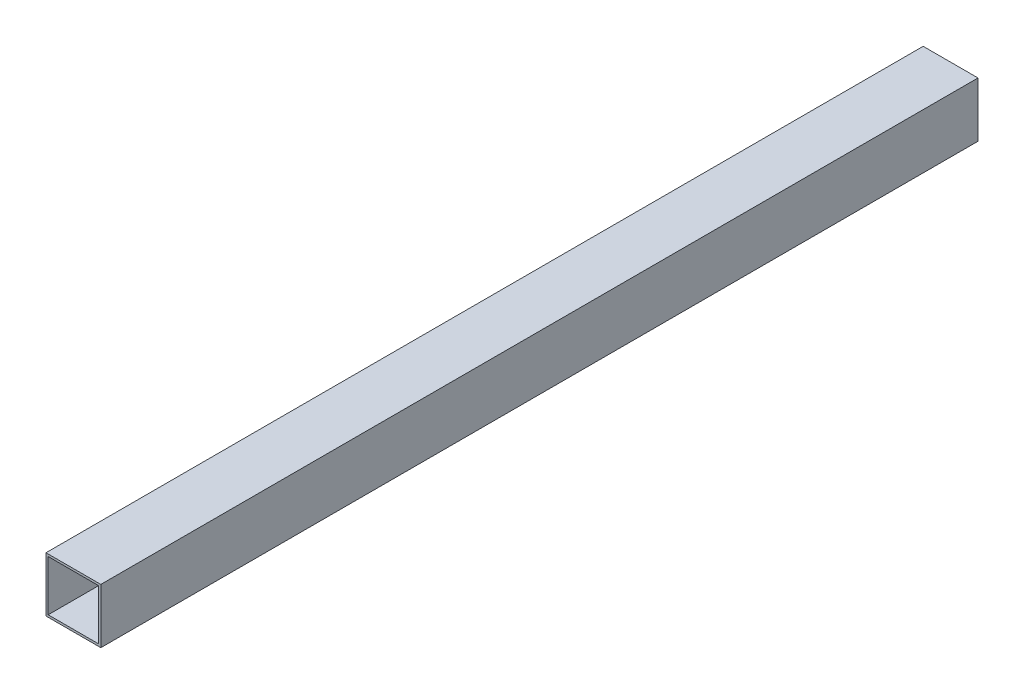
from build123d import *

# Parameters (mm, degrees)
SCHIZZO1_W                = 50
SCHIZZO1_H                = 50
SCHIZZO1_W_2              = 46
SCHIZZO1_H_2              = 46
ESTRUSIONE_SOTTILE1_DEPTH = 800


with BuildPart() as part:
    # Schizzo1 → Estrusione-Sottile1 (new body)
    with BuildSketch(Plane.XY):
        Rectangle(SCHIZZO1_W, SCHIZZO1_H)
        Rectangle(SCHIZZO1_W_2, SCHIZZO1_H_2, mode=Mode.SUBTRACT)
    extrude(amount=ESTRUSIONE_SOTTILE1_DEPTH)


solid = part.part
